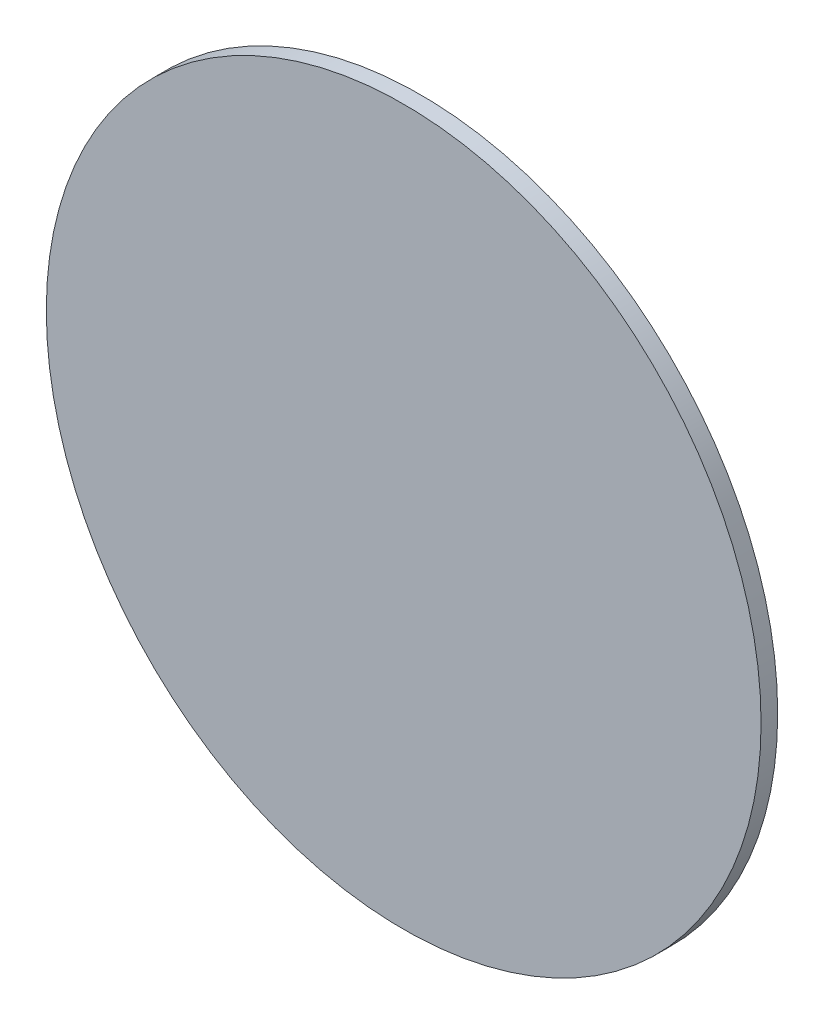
from build123d import *

# Parameters (mm, degrees)
ESQUISSE1_R          = 107.5
BASE_EXTRUSION_DEPTH = 5


with BuildPart() as part:
    # Esquisse1 → Base-Extrusion (new body)
    with BuildSketch(Plane.XY):
        Circle(ESQUISSE1_R)
    extrude(amount=BASE_EXTRUSION_DEPTH)


solid = part.part
